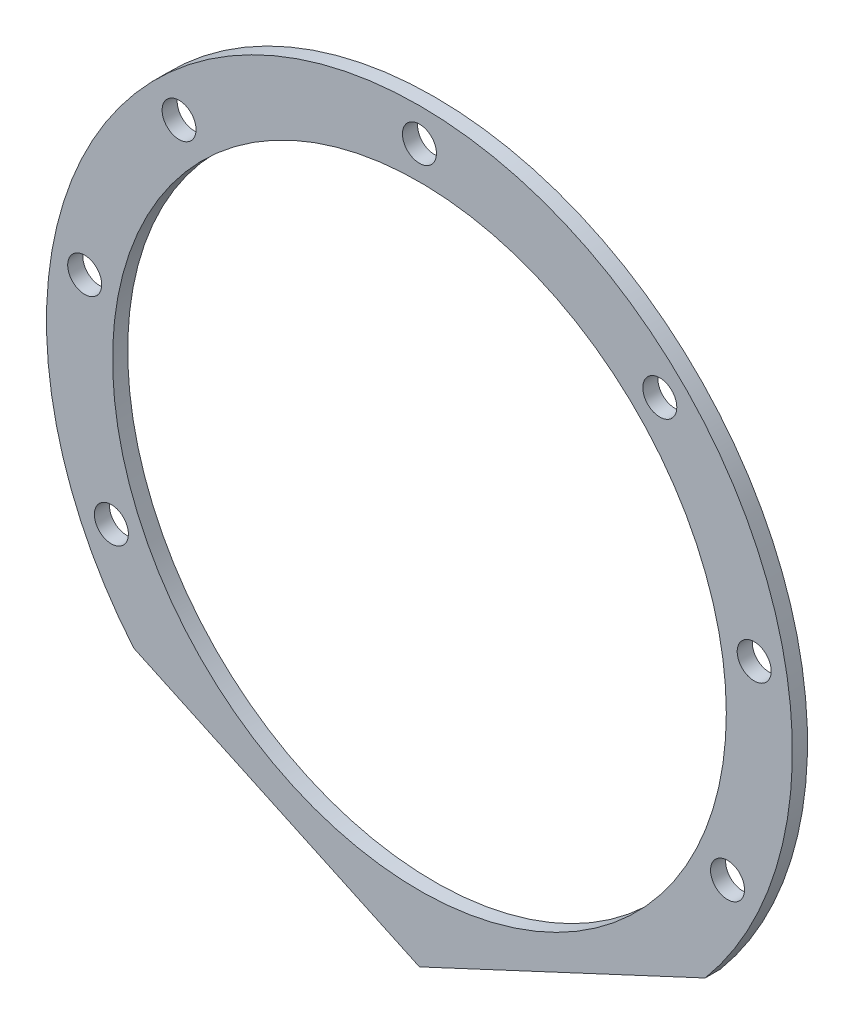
from build123d import *

# Parameters (mm, degrees)
ESQUISSE1_R      = 9
ESQUISSE1_R_2    = 162.5
EXTRUSION1_DEPTH = 8


with BuildPart() as part:
    # Esquisse1 → Extrusion1 (new body)
    with BuildSketch(Plane.XY):
        with BuildLine():
            Line((-151.293777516, -126.950552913), (0, -197.5))
            Line((0, -197.5), (151.293777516, -126.950552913))
            ThreePointArc((151.293777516, -126.950552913), (0, 197.5), (-151.293777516, -126.950552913))
        make_face()
        with Locations((-163.135401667, -76.071287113)):
            Circle(ESQUISSE1_R, mode=Mode.SUBTRACT)
        with Locations((163.135401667, -76.071287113)):
            Circle(ESQUISSE1_R, mode=Mode.SUBTRACT)
        with Locations((-177.265395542, 31.25667198)):
            Circle(ESQUISSE1_R, mode=Mode.SUBTRACT)
        with Locations((-127.279220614, 127.279220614)):
            Circle(ESQUISSE1_R, mode=Mode.SUBTRACT)
        Circle(ESQUISSE1_R_2, mode=Mode.SUBTRACT)
        with Locations((177.265395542, 31.25667198)):
            Circle(ESQUISSE1_R, mode=Mode.SUBTRACT)
        with Locations((0, 180)):
            Circle(ESQUISSE1_R, mode=Mode.SUBTRACT)
        with Locations((127.279220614, 127.279220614)):
            Circle(ESQUISSE1_R, mode=Mode.SUBTRACT)
    extrude(amount=EXTRUSION1_DEPTH)


solid = part.part
